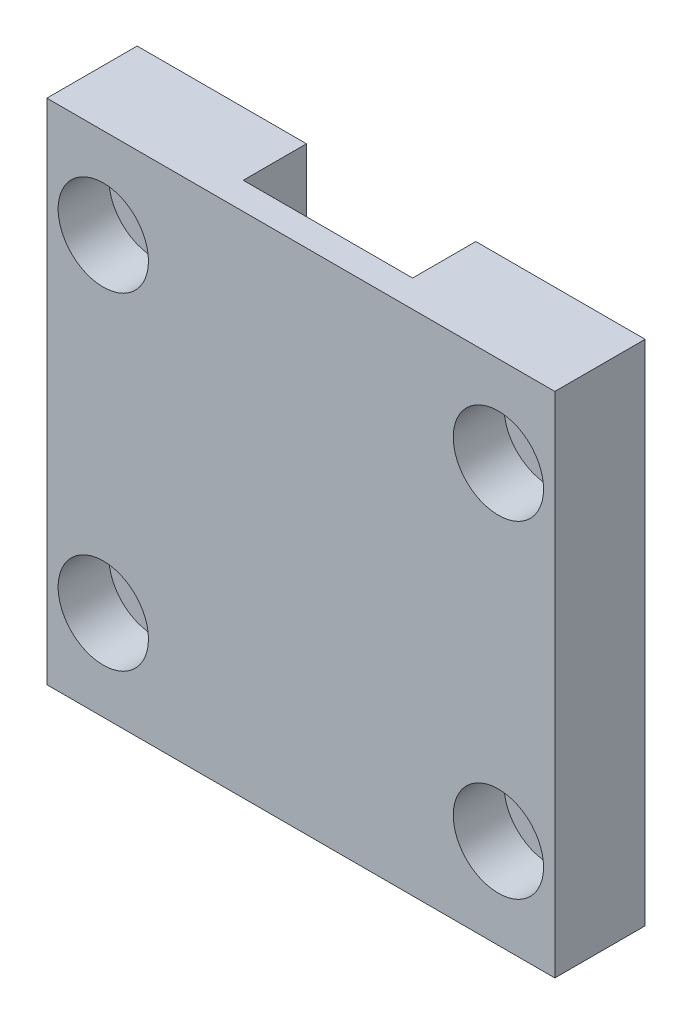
from build123d import *

# Parameters (mm, degrees)
SKETCH_1_W          = 45
SKETCH_1_H          = 45
SKETCH_1_R          = 2.25
EXTRUDE_1_DEPTH     = 8
SKETCH_2_R          = 4
CUT_EXTRUDE_1_DEPTH = 4.5
SKETCH_3_OUTSIDE_W  = 59.828
SKETCH_3_OUTSIDE_H  = 22.828
CUT_EXTRUDE_2_DEPTH = 65.140470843


with BuildPart() as part:
    # Sketch 1 → Extrude 1 (new body)
    with BuildSketch(Plane.XY):
        with Locations((22.5, 22.5)):
            Rectangle(SKETCH_1_W, SKETCH_1_H)
        with Locations((5, 8)):
            Circle(SKETCH_1_R, mode=Mode.SUBTRACT)
        with Locations((40, 8)):
            Circle(SKETCH_1_R, mode=Mode.SUBTRACT)
        with Locations((5, 37)):
            Circle(SKETCH_1_R, mode=Mode.SUBTRACT)
        with Locations((40, 37)):
            Circle(SKETCH_1_R, mode=Mode.SUBTRACT)
    extrude(amount=EXTRUDE_1_DEPTH)

    # Sketch 2 → Cut-Extrude 1 (cut)
    with BuildSketch(Plane.XY.offset(8)):
        with Locations((5, 8)):
            Circle(SKETCH_2_R)
        with Locations((40, 8)):
            Circle(SKETCH_2_R)
        with Locations((5, 37)):
            Circle(SKETCH_2_R)
        with Locations((40, 37)):
            Circle(SKETCH_2_R)
    extrude(amount=-CUT_EXTRUDE_1_DEPTH, mode=Mode.SUBTRACT)

    # Sketch 3 outside → Cut-Extrude 2 (cut, through all)
    with BuildSketch(Plane(origin=(0, 45, 0), x_dir=(1, 0, 0), z_dir=(0, 1, 0))):
        with Locations((22.5, -4)):
            Rectangle(SKETCH_3_OUTSIDE_W, SKETCH_3_OUTSIDE_H)
        Polygon((0, 0), (15, 0), (15, -5.6), (30, -5.6), (30, 0), (45, 0), (45, -8), (0, -8), align=None, mode=Mode.SUBTRACT)
    extrude(amount=-CUT_EXTRUDE_2_DEPTH, mode=Mode.SUBTRACT)


solid = part.part
